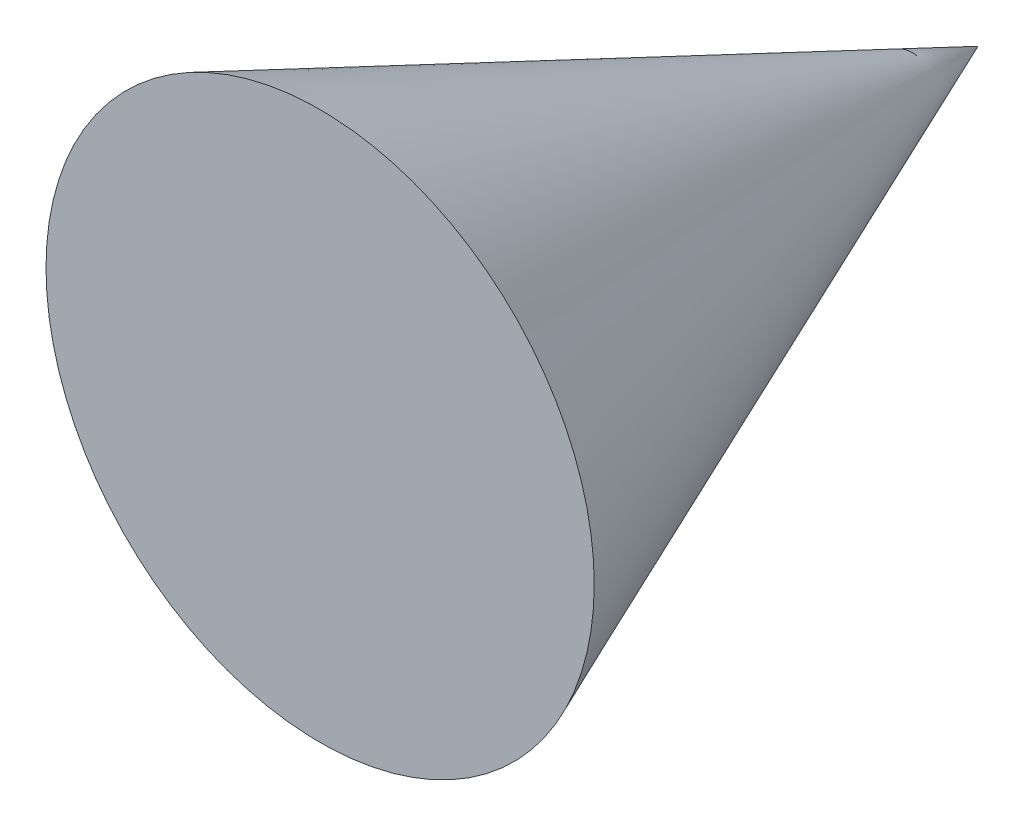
from build123d import *


with BuildPart() as part:
    # Sketch 1 → Revolve 1 (revolve)
    with BuildSketch(Plane(origin=(0, 0, 0), x_dir=(1, 0, 0), z_dir=(0, 1, 0)), mode=Mode.PRIVATE) as revolve_1_sk:
        Polygon((0, 25.635294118), (-25, -34.364705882), (0, -34.364705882), align=None)
    revolve(revolve_1_sk.sketch.rotate(Axis((0, 0, -88.9), (0, 0, 1)), 180), axis=Axis((0, 0, -88.9), (0, 0, 1)))


solid = part.part
